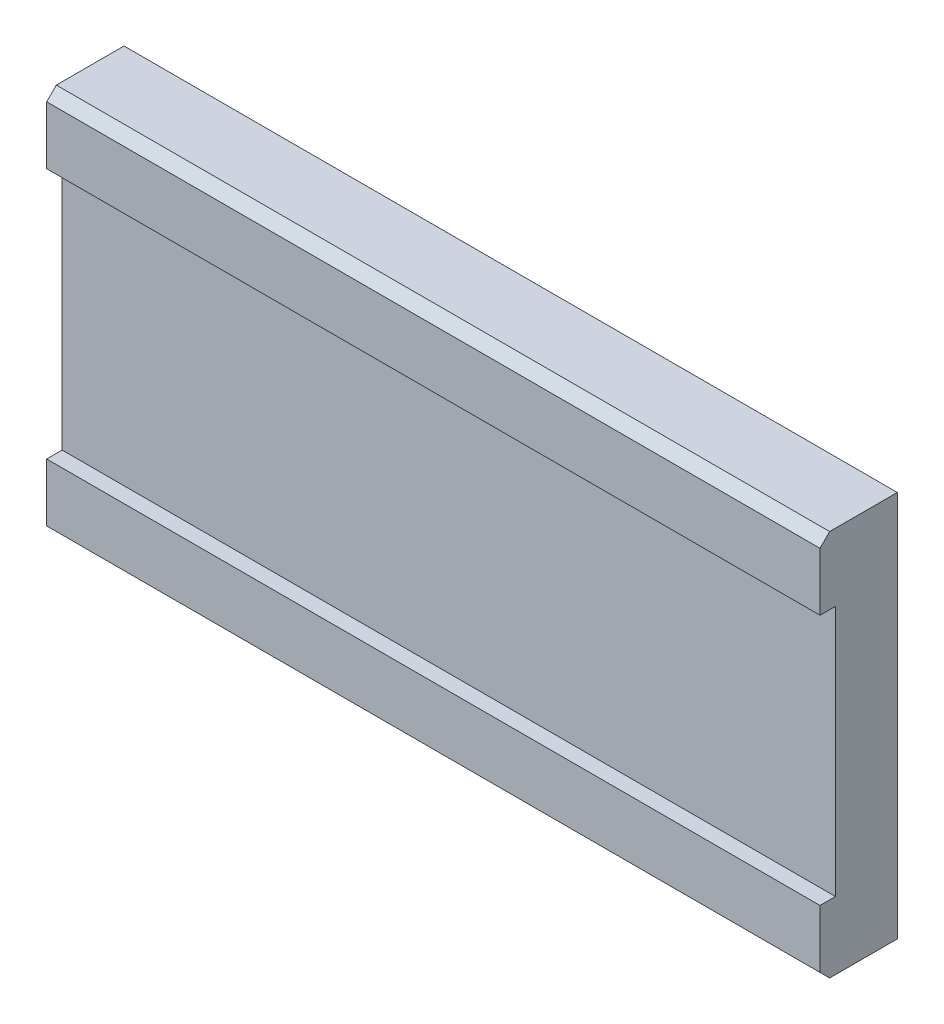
ISO-10303-21;
HEADER;
FILE_DESCRIPTION(('STEP AP214'),'2;1');
FILE_NAME('part.step','',(''),(''),'','','');
FILE_SCHEMA(('AUTOMOTIVE_DESIGN { 1 0 10303 214 1 1 1 1 }'));
ENDSEC;
DATA;
#1=APPLICATION_CONTEXT('core data for automotive mechanical design processes');
#2=APPLICATION_PROTOCOL_DEFINITION('international standard','automotive_design',2000,#1);
#3=PRODUCT_CONTEXT('',#1,'mechanical');
#4=PRODUCT('Part','Part','',(#3));
#5=PRODUCT_RELATED_PRODUCT_CATEGORY('part','',(#4));
#6=PRODUCT_DEFINITION_FORMATION('','',#4);
#7=PRODUCT_DEFINITION_CONTEXT('part definition',#1,'design');
#8=PRODUCT_DEFINITION('design','',#6,#7);
#9=PRODUCT_DEFINITION_SHAPE('','',#8);
#10=(LENGTH_UNIT() NAMED_UNIT(*) SI_UNIT(.MILLI.,.METRE.));
#11=(NAMED_UNIT(*) PLANE_ANGLE_UNIT() SI_UNIT($,.RADIAN.));
#12=(NAMED_UNIT(*) SI_UNIT($,.STERADIAN.) SOLID_ANGLE_UNIT());
#13=UNCERTAINTY_MEASURE_WITH_UNIT(LENGTH_MEASURE(1.E-05),#10,'distance_accuracy_value','');
#14=(GEOMETRIC_REPRESENTATION_CONTEXT(3) GLOBAL_UNCERTAINTY_ASSIGNED_CONTEXT((#13)) GLOBAL_UNIT_ASSIGNED_CONTEXT((#10,
#11,#12)) REPRESENTATION_CONTEXT('',''));
#15=CARTESIAN_POINT('',(0.,0.,0.));
#16=DIRECTION('',(0.,0.,1.));
#17=DIRECTION('',(1.,0.,0.));
#18=AXIS2_PLACEMENT_3D('',#15,#16,#17);
#19=CARTESIAN_POINT('',(0.,100.,20.));
#20=DIRECTION('',(0.,0.,-1.));
#21=DIRECTION('',(-1.,0.,0.));
#22=AXIS2_PLACEMENT_3D('',#19,#20,#21);
#23=PLANE('',#22);
#24=DIRECTION('',(0.,1.,0.));
#25=VECTOR('',#24,1.);
#26=CARTESIAN_POINT('',(200.,0.,20.));
#27=LINE('',#26,#25);
#28=CARTESIAN_POINT('',(200.,82.5,20.));
#29=VERTEX_POINT('',#28);
#30=CARTESIAN_POINT('',(200.,97.5,20.));
#31=VERTEX_POINT('',#30);
#32=EDGE_CURVE('E144',#29,#31,#27,.T.);
#33=ORIENTED_EDGE('',*,*,#32,.T.);
#34=DIRECTION('',(-1.,0.,0.));
#35=VECTOR('',#34,1.);
#36=CARTESIAN_POINT('',(0.,97.5,20.));
#37=LINE('',#36,#35);
#38=CARTESIAN_POINT('',(0.,97.5,20.));
#39=VERTEX_POINT('',#38);
#40=EDGE_CURVE('E168',#31,#39,#37,.T.);
#41=ORIENTED_EDGE('',*,*,#40,.T.);
#42=DIRECTION('',(0.,-1.,0.));
#43=VECTOR('',#42,1.);
#44=CARTESIAN_POINT('',(0.,0.,20.));
#45=LINE('',#44,#43);
#46=CARTESIAN_POINT('',(0.,82.5,20.));
#47=VERTEX_POINT('',#46);
#48=EDGE_CURVE('E142',#39,#47,#45,.T.);
#49=ORIENTED_EDGE('',*,*,#48,.T.);
#50=DIRECTION('',(-1.,0.,0.));
#51=VECTOR('',#50,1.);
#52=CARTESIAN_POINT('',(0.,82.5,20.));
#53=LINE('',#52,#51);
#54=EDGE_CURVE('E129',#29,#47,#53,.T.);
#55=ORIENTED_EDGE('',*,*,#54,.F.);
#56=EDGE_LOOP('',(#33,#41,#49,#55));
#57=FACE_BOUND('',#56,.T.);
#58=ADVANCED_FACE('F33',(#57),#23,.F.);
#59=CARTESIAN_POINT('',(0.,0.,20.));
#60=DIRECTION('',(1.,0.,0.));
#61=DIRECTION('',(0.,0.,-1.));
#62=AXIS2_PLACEMENT_3D('',#59,#60,#61);
#63=PLANE('',#62);
#64=ORIENTED_EDGE('',*,*,#48,.F.);
#65=DIRECTION('',(0.,-0.707106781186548,0.707106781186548));
#66=VECTOR('',#65,1.);
#67=CARTESIAN_POINT('',(0.,97.5,20.));
#68=LINE('',#67,#66);
#69=CARTESIAN_POINT('',(0.,100.,17.5));
#70=VERTEX_POINT('',#69);
#71=EDGE_CURVE('E173',#39,#70,#68,.F.);
#72=ORIENTED_EDGE('',*,*,#71,.T.);
#73=DIRECTION('',(0.,0.,-1.));
#74=VECTOR('',#73,1.);
#75=CARTESIAN_POINT('',(0.,100.,20.));
#76=LINE('',#75,#74);
#77=CARTESIAN_POINT('',(0.,100.,0.));
#78=VERTEX_POINT('',#77);
#79=EDGE_CURVE('E147',#70,#78,#76,.T.);
#80=ORIENTED_EDGE('',*,*,#79,.T.);
#81=DIRECTION('',(0.,-1.,0.));
#82=VECTOR('',#81,1.);
#83=CARTESIAN_POINT('',(0.,0.,0.));
#84=LINE('',#83,#82);
#85=CARTESIAN_POINT('',(0.,0.,0.));
#86=VERTEX_POINT('',#85);
#87=EDGE_CURVE('E148',#78,#86,#84,.T.);
#88=ORIENTED_EDGE('',*,*,#87,.T.);
#89=DIRECTION('',(0.,0.,-1.));
#90=VECTOR('',#89,1.);
#91=CARTESIAN_POINT('',(0.,0.,20.));
#92=LINE('',#91,#90);
#93=CARTESIAN_POINT('',(0.,0.,17.5));
#94=VERTEX_POINT('',#93);
#95=EDGE_CURVE('E166',#94,#86,#92,.T.);
#96=ORIENTED_EDGE('',*,*,#95,.F.);
#97=DIRECTION('',(0.,-0.707106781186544,-0.707106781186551));
#98=VECTOR('',#97,1.);
#99=CARTESIAN_POINT('',(0.,2.5,20.));
#100=LINE('',#99,#98);
#101=CARTESIAN_POINT('',(0.,2.5,20.));
#102=VERTEX_POINT('',#101);
#103=EDGE_CURVE('E171',#94,#102,#100,.F.);
#104=ORIENTED_EDGE('',*,*,#103,.T.);
#105=CARTESIAN_POINT('',(0.,17.5,20.));
#106=VERTEX_POINT('',#105);
#107=EDGE_CURVE('E135',#106,#102,#45,.T.);
#108=ORIENTED_EDGE('',*,*,#107,.F.);
#109=DIRECTION('',(0.,0.,1.));
#110=VECTOR('',#109,1.);
#111=CARTESIAN_POINT('',(0.,17.5,16.));
#112=LINE('',#111,#110);
#113=CARTESIAN_POINT('',(0.,17.5,16.));
#114=VERTEX_POINT('',#113);
#115=EDGE_CURVE('E113',#114,#106,#112,.T.);
#116=ORIENTED_EDGE('',*,*,#115,.F.);
#117=DIRECTION('',(0.,-1.,0.));
#118=VECTOR('',#117,1.);
#119=CARTESIAN_POINT('',(0.,82.5,16.));
#120=LINE('',#119,#118);
#121=CARTESIAN_POINT('',(0.,82.5,16.));
#122=VERTEX_POINT('',#121);
#123=EDGE_CURVE('E120',#122,#114,#120,.T.);
#124=ORIENTED_EDGE('',*,*,#123,.F.);
#125=DIRECTION('',(0.,0.,1.));
#126=VECTOR('',#125,1.);
#127=CARTESIAN_POINT('',(0.,82.5,16.));
#128=LINE('',#127,#126);
#129=EDGE_CURVE('E152',#122,#47,#128,.T.);
#130=ORIENTED_EDGE('',*,*,#129,.T.);
#131=EDGE_LOOP('',(#64,#72,#80,#88,#96,#104,#108,#116,#124,#130));
#132=FACE_BOUND('',#131,.T.);
#133=ADVANCED_FACE('F133',(#132),#63,.F.);
#134=CARTESIAN_POINT('',(0.,0.,20.));
#135=DIRECTION('',(0.,1.,0.));
#136=DIRECTION('',(0.,0.,1.));
#137=AXIS2_PLACEMENT_3D('',#134,#135,#136);
#138=PLANE('',#137);
#139=DIRECTION('',(0.,0.,-1.));
#140=VECTOR('',#139,1.);
#141=CARTESIAN_POINT('',(200.,0.,20.));
#142=LINE('',#141,#140);
#143=CARTESIAN_POINT('',(200.,0.,17.5));
#144=VERTEX_POINT('',#143);
#145=CARTESIAN_POINT('',(200.,0.,0.));
#146=VERTEX_POINT('',#145);
#147=EDGE_CURVE('E164',#144,#146,#142,.T.);
#148=ORIENTED_EDGE('',*,*,#147,.F.);
#149=DIRECTION('',(-1.,0.,0.));
#150=VECTOR('',#149,1.);
#151=CARTESIAN_POINT('',(0.,0.,17.5));
#152=LINE('',#151,#150);
#153=EDGE_CURVE('E11',#144,#94,#152,.T.);
#154=ORIENTED_EDGE('',*,*,#153,.T.);
#155=ORIENTED_EDGE('',*,*,#95,.T.);
#156=DIRECTION('',(1.,0.,0.));
#157=VECTOR('',#156,1.);
#158=CARTESIAN_POINT('',(0.,0.,0.));
#159=LINE('',#158,#157);
#160=EDGE_CURVE('E151',#86,#146,#159,.T.);
#161=ORIENTED_EDGE('',*,*,#160,.T.);
#162=EDGE_LOOP('',(#148,#154,#155,#161));
#163=FACE_BOUND('',#162,.T.);
#164=ADVANCED_FACE('F213',(#163),#138,.F.);
#165=CARTESIAN_POINT('',(200.,0.,20.));
#166=DIRECTION('',(-1.,0.,0.));
#167=DIRECTION('',(0.,0.,1.));
#168=AXIS2_PLACEMENT_3D('',#165,#166,#167);
#169=PLANE('',#168);
#170=DIRECTION('',(0.,0.,-1.));
#171=VECTOR('',#170,1.);
#172=CARTESIAN_POINT('',(200.,100.,20.));
#173=LINE('',#172,#171);
#174=CARTESIAN_POINT('',(200.,100.,17.5));
#175=VERTEX_POINT('',#174);
#176=CARTESIAN_POINT('',(200.,100.,0.));
#177=VERTEX_POINT('',#176);
#178=EDGE_CURVE('E162',#175,#177,#173,.T.);
#179=ORIENTED_EDGE('',*,*,#178,.F.);
#180=DIRECTION('',(0.,0.707106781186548,-0.707106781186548));
#181=VECTOR('',#180,1.);
#182=CARTESIAN_POINT('',(200.,97.5,20.));
#183=LINE('',#182,#181);
#184=EDGE_CURVE('E178',#175,#31,#183,.F.);
#185=ORIENTED_EDGE('',*,*,#184,.T.);
#186=ORIENTED_EDGE('',*,*,#32,.F.);
#187=DIRECTION('',(0.,0.,1.));
#188=VECTOR('',#187,1.);
#189=CARTESIAN_POINT('',(200.,82.5,16.));
#190=LINE('',#189,#188);
#191=CARTESIAN_POINT('',(200.,82.5,16.));
#192=VERTEX_POINT('',#191);
#193=EDGE_CURVE('E137',#192,#29,#190,.T.);
#194=ORIENTED_EDGE('',*,*,#193,.F.);
#195=DIRECTION('',(0.,1.,0.));
#196=VECTOR('',#195,1.);
#197=CARTESIAN_POINT('',(200.,82.5,16.));
#198=LINE('',#197,#196);
#199=CARTESIAN_POINT('',(200.,17.5,16.));
#200=VERTEX_POINT('',#199);
#201=EDGE_CURVE('E119',#200,#192,#198,.T.);
#202=ORIENTED_EDGE('',*,*,#201,.F.);
#203=DIRECTION('',(0.,0.,1.));
#204=VECTOR('',#203,1.);
#205=CARTESIAN_POINT('',(200.,17.5,16.));
#206=LINE('',#205,#204);
#207=CARTESIAN_POINT('',(200.,17.5,20.));
#208=VERTEX_POINT('',#207);
#209=EDGE_CURVE('E116',#200,#208,#206,.T.);
#210=ORIENTED_EDGE('',*,*,#209,.T.);
#211=CARTESIAN_POINT('',(200.,2.5,20.));
#212=VERTEX_POINT('',#211);
#213=EDGE_CURVE('E145',#212,#208,#27,.T.);
#214=ORIENTED_EDGE('',*,*,#213,.F.);
#215=DIRECTION('',(0.,0.707106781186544,0.707106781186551));
#216=VECTOR('',#215,1.);
#217=CARTESIAN_POINT('',(200.,2.5,20.));
#218=LINE('',#217,#216);
#219=EDGE_CURVE('E48',#212,#144,#218,.F.);
#220=ORIENTED_EDGE('',*,*,#219,.T.);
#221=ORIENTED_EDGE('',*,*,#147,.T.);
#222=DIRECTION('',(0.,1.,0.));
#223=VECTOR('',#222,1.);
#224=CARTESIAN_POINT('',(200.,0.,0.));
#225=LINE('',#224,#223);
#226=EDGE_CURVE('E155',#146,#177,#225,.T.);
#227=ORIENTED_EDGE('',*,*,#226,.T.);
#228=EDGE_LOOP('',(#179,#185,#186,#194,#202,#210,#214,#220,#221,#227));
#229=FACE_BOUND('',#228,.T.);
#230=ADVANCED_FACE('F183',(#229),#169,.F.);
#231=CARTESIAN_POINT('',(0.,100.,20.));
#232=DIRECTION('',(0.,-1.,0.));
#233=DIRECTION('',(0.,0.,-1.));
#234=AXIS2_PLACEMENT_3D('',#231,#232,#233);
#235=PLANE('',#234);
#236=ORIENTED_EDGE('',*,*,#79,.F.);
#237=DIRECTION('',(1.,0.,0.));
#238=VECTOR('',#237,1.);
#239=CARTESIAN_POINT('',(0.,100.,17.5));
#240=LINE('',#239,#238);
#241=EDGE_CURVE('E175',#70,#175,#240,.T.);
#242=ORIENTED_EDGE('',*,*,#241,.T.);
#243=ORIENTED_EDGE('',*,*,#178,.T.);
#244=DIRECTION('',(-1.,0.,0.));
#245=VECTOR('',#244,1.);
#246=CARTESIAN_POINT('',(0.,100.,0.));
#247=LINE('',#246,#245);
#248=EDGE_CURVE('E158',#177,#78,#247,.T.);
#249=ORIENTED_EDGE('',*,*,#248,.T.);
#250=EDGE_LOOP('',(#236,#242,#243,#249));
#251=FACE_BOUND('',#250,.T.);
#252=ADVANCED_FACE('F204',(#251),#235,.F.);
#253=ORIENTED_EDGE('',*,*,#107,.T.);
#254=DIRECTION('',(1.,0.,0.));
#255=VECTOR('',#254,1.);
#256=CARTESIAN_POINT('',(0.,2.5,20.));
#257=LINE('',#256,#255);
#258=EDGE_CURVE('E41',#102,#212,#257,.T.);
#259=ORIENTED_EDGE('',*,*,#258,.T.);
#260=ORIENTED_EDGE('',*,*,#213,.T.);
#261=DIRECTION('',(1.,0.,0.));
#262=VECTOR('',#261,1.);
#263=CARTESIAN_POINT('',(0.,17.5,20.));
#264=LINE('',#263,#262);
#265=EDGE_CURVE('E188',#106,#208,#264,.T.);
#266=ORIENTED_EDGE('',*,*,#265,.F.);
#267=EDGE_LOOP('',(#253,#259,#260,#266));
#268=FACE_BOUND('',#267,.T.);
#269=ADVANCED_FACE('F180',(#268),#23,.F.);
#270=CARTESIAN_POINT('',(0.,100.,0.));
#271=DIRECTION('',(0.,0.,-1.));
#272=DIRECTION('',(-1.,0.,0.));
#273=AXIS2_PLACEMENT_3D('',#270,#271,#272);
#274=PLANE('',#273);
#275=ORIENTED_EDGE('',*,*,#87,.F.);
#276=ORIENTED_EDGE('',*,*,#248,.F.);
#277=ORIENTED_EDGE('',*,*,#226,.F.);
#278=ORIENTED_EDGE('',*,*,#160,.F.);
#279=EDGE_LOOP('',(#275,#276,#277,#278));
#280=FACE_BOUND('',#279,.T.);
#281=ADVANCED_FACE('F210',(#280),#274,.T.);
#282=CARTESIAN_POINT('',(0.,82.5,16.));
#283=DIRECTION('',(0.,1.,0.));
#284=DIRECTION('',(0.,0.,1.));
#285=AXIS2_PLACEMENT_3D('',#282,#283,#284);
#286=PLANE('',#285);
#287=ORIENTED_EDGE('',*,*,#54,.T.);
#288=ORIENTED_EDGE('',*,*,#129,.F.);
#289=DIRECTION('',(-1.,0.,0.));
#290=VECTOR('',#289,1.);
#291=CARTESIAN_POINT('',(0.,82.5,16.));
#292=LINE('',#291,#290);
#293=EDGE_CURVE('E126',#192,#122,#292,.T.);
#294=ORIENTED_EDGE('',*,*,#293,.F.);
#295=ORIENTED_EDGE('',*,*,#193,.T.);
#296=EDGE_LOOP('',(#287,#288,#294,#295));
#297=FACE_BOUND('',#296,.T.);
#298=ADVANCED_FACE('F194',(#297),#286,.F.);
#299=CARTESIAN_POINT('',(0.,17.5,16.));
#300=DIRECTION('',(0.,-1.,0.));
#301=DIRECTION('',(0.,0.,-1.));
#302=AXIS2_PLACEMENT_3D('',#299,#300,#301);
#303=PLANE('',#302);
#304=ORIENTED_EDGE('',*,*,#265,.T.);
#305=ORIENTED_EDGE('',*,*,#209,.F.);
#306=DIRECTION('',(1.,0.,0.));
#307=VECTOR('',#306,1.);
#308=CARTESIAN_POINT('',(0.,17.5,16.));
#309=LINE('',#308,#307);
#310=EDGE_CURVE('E108',#114,#200,#309,.T.);
#311=ORIENTED_EDGE('',*,*,#310,.F.);
#312=ORIENTED_EDGE('',*,*,#115,.T.);
#313=EDGE_LOOP('',(#304,#305,#311,#312));
#314=FACE_BOUND('',#313,.T.);
#315=ADVANCED_FACE('F111',(#314),#303,.F.);
#316=CARTESIAN_POINT('',(0.,17.5,16.));
#317=DIRECTION('',(0.,0.,1.));
#318=DIRECTION('',(1.,0.,0.));
#319=AXIS2_PLACEMENT_3D('',#316,#317,#318);
#320=PLANE('',#319);
#321=ORIENTED_EDGE('',*,*,#123,.T.);
#322=ORIENTED_EDGE('',*,*,#310,.T.);
#323=ORIENTED_EDGE('',*,*,#201,.T.);
#324=ORIENTED_EDGE('',*,*,#293,.T.);
#325=EDGE_LOOP('',(#321,#322,#323,#324));
#326=FACE_BOUND('',#325,.T.);
#327=ADVANCED_FACE('F124',(#326),#320,.T.);
#328=CARTESIAN_POINT('',(0.,97.5,20.));
#329=DIRECTION('',(0.,-0.707106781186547,-0.707106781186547));
#330=DIRECTION('',(0.,0.707106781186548,-0.707106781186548));
#331=AXIS2_PLACEMENT_3D('',#328,#329,#330);
#332=PLANE('',#331);
#333=ORIENTED_EDGE('',*,*,#184,.F.);
#334=ORIENTED_EDGE('',*,*,#241,.F.);
#335=ORIENTED_EDGE('',*,*,#71,.F.);
#336=ORIENTED_EDGE('',*,*,#40,.F.);
#337=EDGE_LOOP('',(#333,#334,#335,#336));
#338=FACE_BOUND('',#337,.T.);
#339=ADVANCED_FACE('F201',(#338),#332,.F.);
#340=CARTESIAN_POINT('',(0.,2.5,20.));
#341=DIRECTION('',(0.,0.707106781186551,-0.707106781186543));
#342=DIRECTION('',(0.,0.707106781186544,0.707106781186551));
#343=AXIS2_PLACEMENT_3D('',#340,#341,#342);
#344=PLANE('',#343);
#345=ORIENTED_EDGE('',*,*,#103,.F.);
#346=ORIENTED_EDGE('',*,*,#153,.F.);
#347=ORIENTED_EDGE('',*,*,#219,.F.);
#348=ORIENTED_EDGE('',*,*,#258,.F.);
#349=EDGE_LOOP('',(#345,#346,#347,#348));
#350=FACE_BOUND('',#349,.T.);
#351=ADVANCED_FACE('F35',(#350),#344,.F.);
#352=CLOSED_SHELL('',(#58,#133,#164,#230,#252,#269,#281,#298,#315,#327,#339,#351));
#353=MANIFOLD_SOLID_BREP('B2',#352);
#354=ADVANCED_BREP_SHAPE_REPRESENTATION('',(#18,#353),#14);
#355=SHAPE_DEFINITION_REPRESENTATION(#9,#354);
ENDSEC;
END-ISO-10303-21;
